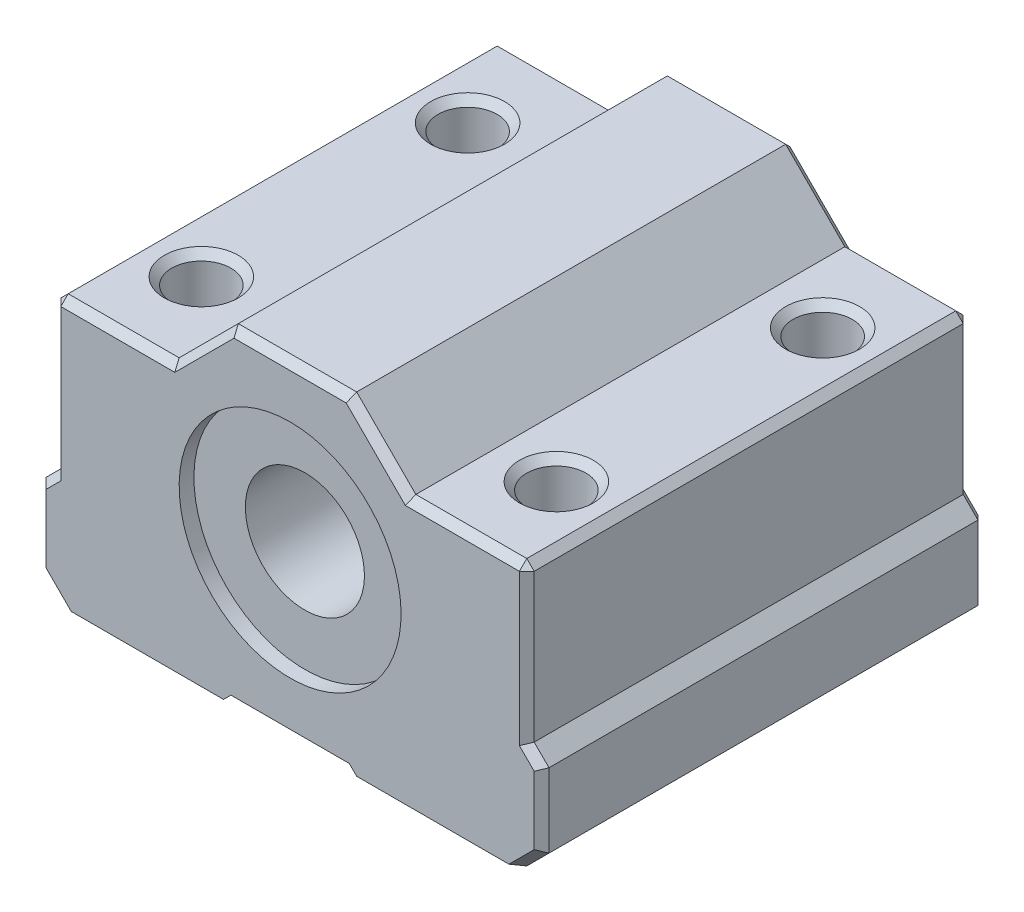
from build123d import *

# Parameters (mm, degrees)
SKIZZE1_W                          = 34
SKIZZE1_H                          = 30
AUFSATZ_LINEAR_AUSTRAGEN1_DEPTH    = 22
SKIZZE2_W                          = 1
SKIZZE2_H                          = 14.5
SCHNITT_LINEAR_AUSTRAGEN1_DEPTH    = 38.007767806
SKIZZE3_W                          = 12
SKIZZE3_H                          = 4
SCHNITT_LINEAR_AUSTRAGEN2_DEPTH    = 38.007767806
SKIZZE4_W                          = 13
SKIZZE4_H                          = 4
SCHNITT_LINEAR_AUSTRAGEN3_DEPTH    = 38.007767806
SKIZZE5_W                          = 1
SKIZZE5_H                          = 10.5
SCHNITT_LINEAR_AUSTRAGEN4_DEPTH    = 38.007767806
SKIZZE6_W                          = 8
SKIZZE6_H                          = 0.5
SCHNITT_LINEAR_AUSTRAGEN5_DEPTH    = 38.007767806
FORMSCHR_GE1_ANGLE                 = 45
FORMSCHR_GE2_ANGLE                 = 45
FORMSCHR_GE3_ANGLE                 = 45
FORMSCHR_GE4_ANGLE                 = 45
F_4_0_4_DURCHMESSER_BOHRUNG1_D     = 4
F_4_0_4_DURCHMESSER_BOHRUNG1_DEPTH = 22
FASE1_SIZE                         = 1.5
FASE2_SIZE                         = 0.5


with BuildPart() as part:
    # Skizze1 → Aufsatz-Linear austragen1 (new body)
    with BuildSketch(Plane(origin=(0, 13.318571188, 0), x_dir=(1, 0, 0), z_dir=(0, 1, 0))):
        with Locations((0.093581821, -15)):
            Rectangle(SKIZZE1_W, SKIZZE1_H)
    extrude(amount=-AUFSATZ_LINEAR_AUSTRAGEN1_DEPTH)

    # Skizze2 → Schnitt-Linear austragen1 (cut, through all)
    with BuildSketch(Plane(origin=(0, 0, 0), x_dir=(-1, 0, 0), z_dir=(0, 0, -1))):
        with Locations((-16.593581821, 6.068571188)):
            Rectangle(SKIZZE2_W, SKIZZE2_H)
    extrude(amount=-SCHNITT_LINEAR_AUSTRAGEN1_DEPTH, mode=Mode.SUBTRACT)

    # Skizze3 → Schnitt-Linear austragen2 (cut, through all)
    with BuildSketch(Plane(origin=(0, 0, 0), x_dir=(-1, 0, 0), z_dir=(0, 0, -1))):
        with Locations((-10.093581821, 11.318571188)):
            Rectangle(SKIZZE3_W, SKIZZE3_H)
    extrude(amount=-SCHNITT_LINEAR_AUSTRAGEN2_DEPTH, mode=Mode.SUBTRACT)

    # Skizze4 → Schnitt-Linear austragen3 (cut, through all)
    with BuildSketch(Plane(origin=(0, 0, 0), x_dir=(-1, 0, 0), z_dir=(0, 0, -1))):
        with Locations((10.406418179, 11.318571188)):
            Rectangle(SKIZZE4_W, SKIZZE4_H)
    extrude(amount=-SCHNITT_LINEAR_AUSTRAGEN3_DEPTH, mode=Mode.SUBTRACT)

    # Skizze5 → Schnitt-Linear austragen4 (cut, through all)
    with BuildSketch(Plane(origin=(0, 0, 0), x_dir=(-1, 0, 0), z_dir=(0, 0, -1))):
        with Locations((16.406418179, 4.068571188)):
            Rectangle(SKIZZE5_W, SKIZZE5_H)
    extrude(amount=-SCHNITT_LINEAR_AUSTRAGEN4_DEPTH, mode=Mode.SUBTRACT)

    # Skizze6 → Schnitt-Linear austragen5 (cut, through all)
    with BuildSketch(Plane(origin=(0, 0, 0), x_dir=(-1, 0, 0), z_dir=(0, 0, -1))):
        with Locations((-0.093581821, -8.431428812)):
            Rectangle(SKIZZE6_W, SKIZZE6_H)
    extrude(amount=-SCHNITT_LINEAR_AUSTRAGEN5_DEPTH, mode=Mode.SUBTRACT)

    # Formschr_ge1
    formschr_ge1_faces = [part.faces().sort_by_distance(p)[0] for p in [
        (16.593581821, -1.181428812, 15),
    ]]
    draft(formschr_ge1_faces, Plane(origin=(16.093581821, -1.181428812, 30), x_dir=(0, 0, 1), z_dir=(1, 0, 0)), FORMSCHR_GE1_ANGLE)

    # Formschr_ge2
    formschr_ge2_faces = [part.faces().sort_by_distance(p)[0] for p in [
        (-16.406418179, -1.181428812, 15),
    ]]
    draft(formschr_ge2_faces, Plane(origin=(-15.906418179, 9.318571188, 30), x_dir=(0, 0, -1), z_dir=(-1, 0, 0)), FORMSCHR_GE2_ANGLE)

    # Formschr_ge3
    formschr_ge3_faces = [part.faces().sort_by_distance(p)[0] for p in [
        (4.093581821, 11.318571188, 15),
        (-3.906418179, 11.318571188, 15),
    ]]
    draft(formschr_ge3_faces, Plane.ZX.offset(13.318571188), FORMSCHR_GE3_ANGLE)

    # Formschr_ge4
    formschr_ge4_faces = [part.faces().sort_by_distance(p)[0] for p in [
        (4.093581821, -8.431428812, 15),
        (-3.906418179, -8.431428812, 15),
    ]]
    draft(formschr_ge4_faces, Plane(origin=(-3.906418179, -8.181428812, 30), x_dir=(0, 0, -1), z_dir=(0, -1, 0)), FORMSCHR_GE4_ANGLE)

    # Skizze7 → Schnitt-Rotation1 (revolve, cut)
    with BuildSketch(Plane.XZ.offset(-2.318571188), mode=Mode.PRIVATE) as schnitt_rotation1_sk:
        Polygon((7.593581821, 30), (0.093581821, 30), (0.093581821, 0), (7.593581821, 0), (7.593581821, 1), (4.118581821, 1), (4.118581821, 29), (7.593581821, 29), align=None)
    revolve(schnitt_rotation1_sk.sketch.rotate(Axis((0.093581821, 2.318571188, 30), (0, 0, -1)), 270), axis=Axis((0.093581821, 2.318571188, 30), (0, 0, -1)), mode=Mode.SUBTRACT)

    # 4.0 _4_ Durchmesser Bohrung1
    with Locations(Plane(origin=(0, -8.681428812, 0), x_dir=(-1, 0, 0), z_dir=(0, -1, 0))):
        with Locations((11.906418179, -6), (11.906418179, -24), (-12.093581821, -6), (-12.093581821, -24)):
            Hole(F_4_0_4_DURCHMESSER_BOHRUNG1_D / 2, depth=F_4_0_4_DURCHMESSER_BOHRUNG1_DEPTH)

    # Fase1
    fase1_edges = [part.edges().sort_by_distance(p)[0] for p in [
        (-16.906418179, -8.681428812, 15),
        (17.093581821, -8.681428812, 15),
    ]]
    chamfer(fase1_edges, length=FASE1_SIZE)

    # Fase2
    fase2_edges = [part.edges().sort_by_distance(p)[0] for p in [
        (10.093581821, 9.318571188, 24),
        (10.093581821, -8.681428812, 24),
        (10.093581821, 9.318571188, 6),
        (10.093581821, -8.681428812, 6),
        (-13.906418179, 9.318571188, 24),
        (-13.906418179, -8.681428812, 24),
        (-13.906418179, 9.318571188, 6),
        (-13.906418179, -8.681428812, 6),
        (17.093581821, -4.681428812, 30),
        (17.093581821, -4.681428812, 0),
        (-16.906418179, -4.681428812, 0),
        (-16.156418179, -7.931428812, 0),
        (16.343581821, -7.931428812, 0),
        (-16.906418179, -4.681428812, 30),
        (-16.156418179, -7.931428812, 30),
        (16.343581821, -7.931428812, 30),
        (16.093581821, 4.068571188, 30),
        (16.593581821, -1.681428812, 30),
        (16.593581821, -1.681428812, 0),
        (16.093581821, 4.068571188, 0),
        (0.093581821, 13.318571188, 0),
        (12.093581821, 9.318571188, 30),
        (16.093581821, 9.318571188, 15),
        (6.093581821, 11.318571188, 30),
        (12.093581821, 9.318571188, 0),
        (6.093581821, 11.318571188, 0),
        (0.093581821, 13.318571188, 30),
        (-5.906418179, 11.318571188, 30),
        (-11.906418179, 9.318571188, 30),
        (-5.906418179, 11.318571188, 0),
        (-11.906418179, 9.318571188, 0),
        (-15.906418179, 4.068571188, 30),
        (-15.906418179, 9.318571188, 15),
        (-16.406418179, -1.681428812, 30),
        (-15.906418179, 4.068571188, 0),
        (-16.406418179, -1.681428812, 0),
    ]]
    chamfer(fase2_edges, length=FASE2_SIZE)


solid = part.part
